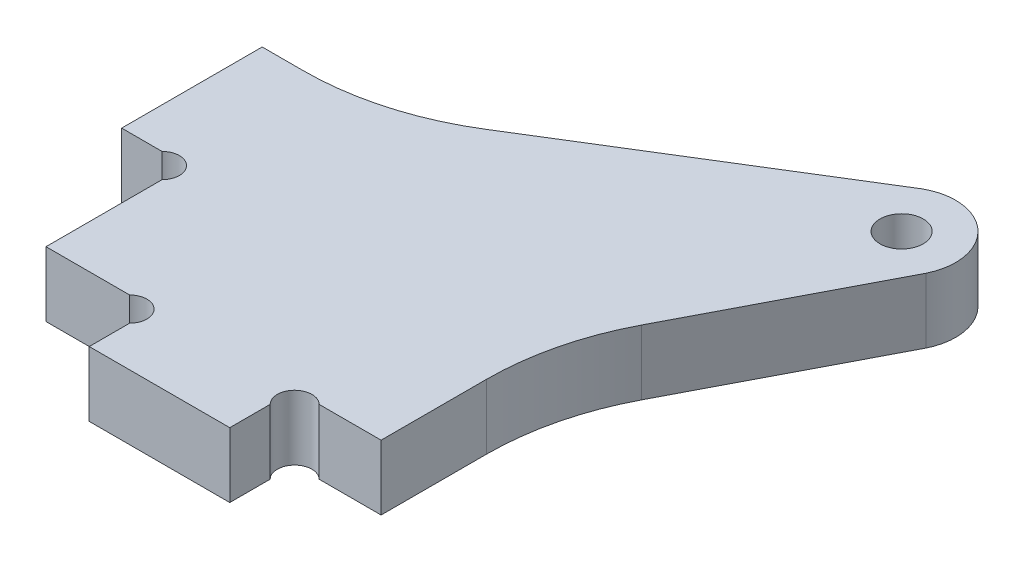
from build123d import *

# Parameters (mm, degrees)
ESQUISSE1_R      = 2
EXTRUSION1_DEPTH = 6


with BuildPart() as part:
    # Esquisse1 → Extrusion1 (new body)
    with BuildSketch(Plane(origin=(0, 0, 0), x_dir=(1, 0, 0), z_dir=(0, 1, 0))):
        with BuildLine():
            Line((-6, 26), (-6, 13))
            Line((-6, 13), (-2.2627417, 13))
            ThreePointArc((-2.2627417, 13), (0, 13), (0, 10.7372583))
            Line((0, 10.7372583), (0, 0))
            Line((0, 0), (7.7372583, 0))
            ThreePointArc((7.7372583, 0), (10, 0), (10, -2.2627417))
            Line((10, -2.2627417), (10, -6))
            Line((10, -6), (23, -6))
            Line((23, -6), (23, -2.2627417))
            ThreePointArc((23, -2.2627417), (23, 0), (25.2627417, 0))
            Line((25.2627417, 0), (31, 0))
            Line((31, 0), (31, 9.734635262))
            ThreePointArc((31, 9.734635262), (31.716316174, 15.676242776), (33.824215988, 21.277364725))
            Line((33.824215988, 21.277364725), (42.824020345, 38.567704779))
            ThreePointArc((42.824020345, 38.567704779), (41.767649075, 44.449612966), (35.829129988, 45.118010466))
            Line((35.829129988, 45.118010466), (10.907356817, 29.728696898))
            ThreePointArc((10.907356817, 29.728696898), (4.599283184, 26.950233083), (-2.227774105, 26))
            Line((-2.227774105, 26), (-6, 26))
        make_face()
        with Locations(Location((38.35, 40.8, 0), (0, 0, 270))):
            Circle(ESQUISSE1_R, mode=Mode.SUBTRACT)
    extrude(amount=EXTRUSION1_DEPTH)


solid = part.part
